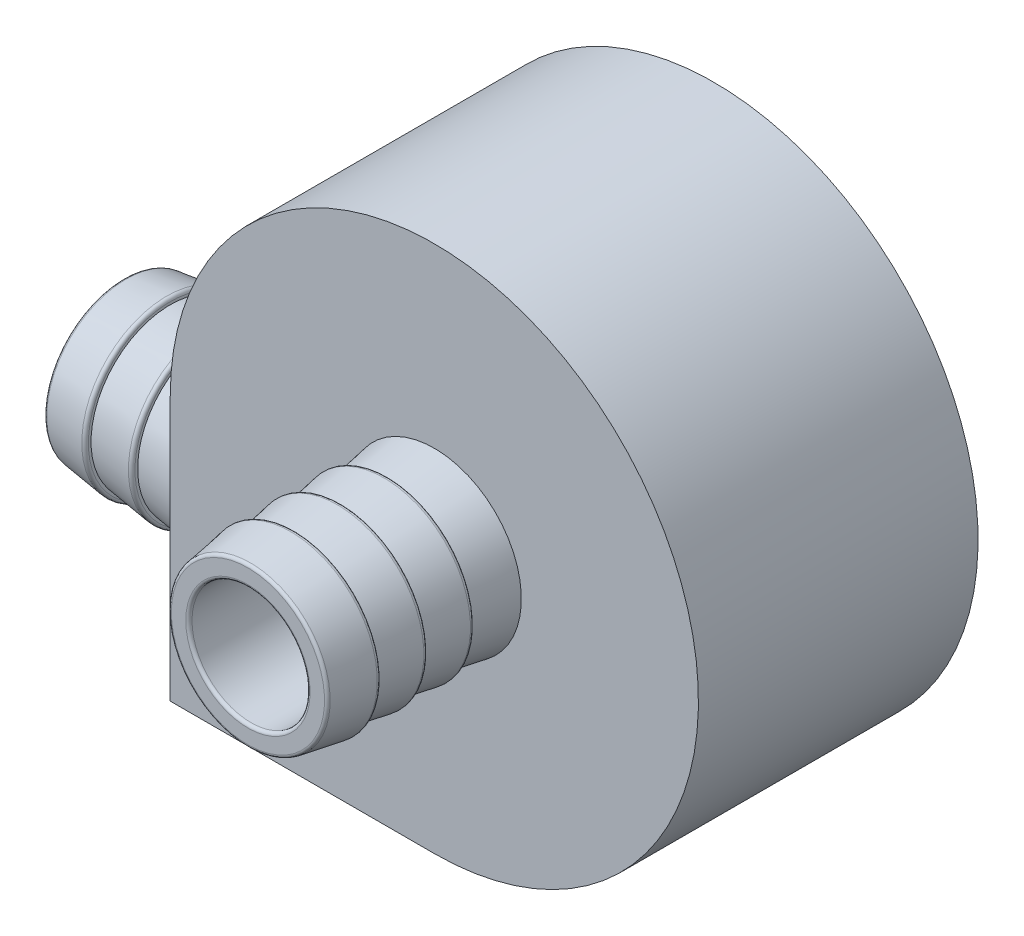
ISO-10303-21;
HEADER;
FILE_DESCRIPTION(('STEP AP214'),'2;1');
FILE_NAME('part.step','',(''),(''),'','','');
FILE_SCHEMA(('AUTOMOTIVE_DESIGN { 1 0 10303 214 1 1 1 1 }'));
ENDSEC;
DATA;
#1=APPLICATION_CONTEXT('core data for automotive mechanical design processes');
#2=APPLICATION_PROTOCOL_DEFINITION('international standard','automotive_design',2000,#1);
#3=PRODUCT_CONTEXT('',#1,'mechanical');
#4=PRODUCT('Part','Part','',(#3));
#5=PRODUCT_RELATED_PRODUCT_CATEGORY('part','',(#4));
#6=PRODUCT_DEFINITION_FORMATION('','',#4);
#7=PRODUCT_DEFINITION_CONTEXT('part definition',#1,'design');
#8=PRODUCT_DEFINITION('design','',#6,#7);
#9=PRODUCT_DEFINITION_SHAPE('','',#8);
#10=(LENGTH_UNIT() NAMED_UNIT(*) SI_UNIT(.MILLI.,.METRE.));
#11=(NAMED_UNIT(*) PLANE_ANGLE_UNIT() SI_UNIT($,.RADIAN.));
#12=(NAMED_UNIT(*) SI_UNIT($,.STERADIAN.) SOLID_ANGLE_UNIT());
#13=UNCERTAINTY_MEASURE_WITH_UNIT(LENGTH_MEASURE(1.E-05),#10,'distance_accuracy_value','');
#14=(GEOMETRIC_REPRESENTATION_CONTEXT(3) GLOBAL_UNCERTAINTY_ASSIGNED_CONTEXT((#13)) GLOBAL_UNIT_ASSIGNED_CONTEXT((#10,
#11,#12)) REPRESENTATION_CONTEXT('',''));
#15=CARTESIAN_POINT('',(0.,0.,0.));
#16=DIRECTION('',(0.,0.,1.));
#17=DIRECTION('',(1.,0.,0.));
#18=AXIS2_PLACEMENT_3D('',#15,#16,#17);
#19=CARTESIAN_POINT('',(-21.59,0.,22.86));
#20=DIRECTION('',(1.,0.,0.));
#21=DIRECTION('',(0.,0.,-1.));
#22=AXIS2_PLACEMENT_3D('',#19,#20,#21);
#23=PLANE('',#22);
#24=DIRECTION('',(0.,-1.,0.));
#25=VECTOR('',#24,1.);
#26=CARTESIAN_POINT('',(-21.59,0.,0.));
#27=LINE('',#26,#25);
#28=CARTESIAN_POINT('',(-21.59,0.,0.));
#29=VERTEX_POINT('',#28);
#30=CARTESIAN_POINT('',(-21.59,-21.59,0.));
#31=VERTEX_POINT('',#30);
#32=EDGE_CURVE('E174',#29,#31,#27,.T.);
#33=ORIENTED_EDGE('',*,*,#32,.T.);
#34=DIRECTION('',(0.,0.,-1.));
#35=VECTOR('',#34,1.);
#36=CARTESIAN_POINT('',(-21.59,-21.59,22.86));
#37=LINE('',#36,#35);
#38=CARTESIAN_POINT('',(-21.59,-21.59,22.86));
#39=VERTEX_POINT('',#38);
#40=EDGE_CURVE('E178',#39,#31,#37,.T.);
#41=ORIENTED_EDGE('',*,*,#40,.F.);
#42=DIRECTION('',(0.,-1.,0.));
#43=VECTOR('',#42,1.);
#44=CARTESIAN_POINT('',(-21.59,0.,22.86));
#45=LINE('',#44,#43);
#46=CARTESIAN_POINT('',(-21.59,0.,22.86));
#47=VERTEX_POINT('',#46);
#48=EDGE_CURVE('E93',#47,#39,#45,.T.);
#49=ORIENTED_EDGE('',*,*,#48,.F.);
#50=DIRECTION('',(0.,0.,-1.));
#51=VECTOR('',#50,1.);
#52=CARTESIAN_POINT('',(-21.59,0.,22.86));
#53=LINE('',#52,#51);
#54=EDGE_CURVE('E180',#47,#29,#53,.T.);
#55=ORIENTED_EDGE('',*,*,#54,.T.);
#56=EDGE_LOOP('',(#33,#41,#49,#55));
#57=FACE_BOUND('',#56,.T.);
#58=CARTESIAN_POINT('',(-21.59,-11.43,11.43));
#59=DIRECTION('',(1.,0.,0.));
#60=DIRECTION('',(0.,0.,-1.));
#61=AXIS2_PLACEMENT_3D('',#58,#59,#60);
#62=CIRCLE('',#61,6.985);
#63=CARTESIAN_POINT('',(-21.59,-11.43,4.445));
#64=VERTEX_POINT('',#63);
#65=EDGE_CURVE('E98',#64,#64,#62,.F.);
#66=ORIENTED_EDGE('',*,*,#65,.F.);
#67=EDGE_LOOP('',(#66));
#68=FACE_BOUND('',#67,.T.);
#69=ADVANCED_FACE('F41',(#57,#68),#23,.F.);
#70=CARTESIAN_POINT('',(0.,0.,22.86));
#71=DIRECTION('',(0.,0.,-1.));
#72=DIRECTION('',(-1.,0.,0.));
#73=AXIS2_PLACEMENT_3D('',#70,#71,#72);
#74=CYLINDRICAL_SURFACE('',#73,4.826);
#75=CARTESIAN_POINT('',(0.,0.,37.846));
#76=DIRECTION('',(0.,0.,-1.));
#77=DIRECTION('',(-1.,0.,0.));
#78=AXIS2_PLACEMENT_3D('',#75,#76,#77);
#79=CIRCLE('',#78,4.826);
#80=CARTESIAN_POINT('',(-4.826,0.,37.846));
#81=VERTEX_POINT('',#80);
#82=EDGE_CURVE('E163',#81,#81,#79,.T.);
#83=ORIENTED_EDGE('',*,*,#82,.F.);
#84=EDGE_LOOP('',(#83));
#85=FACE_BOUND('',#84,.T.);
#86=CARTESIAN_POINT('',(0.,0.,20.32));
#87=DIRECTION('',(0.,0.,-1.));
#88=DIRECTION('',(-1.,0.,0.));
#89=AXIS2_PLACEMENT_3D('',#86,#87,#88);
#90=CIRCLE('',#89,4.826);
#91=CARTESIAN_POINT('',(-4.826,0.,20.32));
#92=VERTEX_POINT('',#91);
#93=EDGE_CURVE('E118',#92,#92,#90,.F.);
#94=ORIENTED_EDGE('',*,*,#93,.F.);
#95=EDGE_LOOP('',(#94));
#96=FACE_BOUND('',#95,.T.);
#97=ADVANCED_FACE('F190',(#85,#96),#74,.F.);
#98=CARTESIAN_POINT('',(0.,0.,22.86));
#99=DIRECTION('',(0.,0.,1.));
#100=DIRECTION('',(1.,0.,0.));
#101=AXIS2_PLACEMENT_3D('',#98,#99,#100);
#102=PLANE('',#101);
#103=CARTESIAN_POINT('',(0.,0.,22.86));
#104=DIRECTION('',(0.,0.,1.));
#105=DIRECTION('',(1.,0.,0.));
#106=AXIS2_PLACEMENT_3D('',#103,#104,#105);
#107=CIRCLE('',#106,21.59);
#108=CARTESIAN_POINT('',(0.,-21.59,22.86));
#109=VERTEX_POINT('',#108);
#110=EDGE_CURVE('E167',#109,#47,#107,.T.);
#111=ORIENTED_EDGE('',*,*,#110,.T.);
#112=ORIENTED_EDGE('',*,*,#48,.T.);
#113=DIRECTION('',(1.,0.,0.));
#114=VECTOR('',#113,1.);
#115=CARTESIAN_POINT('',(0.,-21.59,22.86));
#116=LINE('',#115,#114);
#117=EDGE_CURVE('E70',#39,#109,#116,.T.);
#118=ORIENTED_EDGE('',*,*,#117,.T.);
#119=EDGE_LOOP('',(#111,#112,#118));
#120=FACE_BOUND('',#119,.T.);
#121=CARTESIAN_POINT('',(0.,0.,22.86));
#122=DIRECTION('',(0.,0.,-1.));
#123=DIRECTION('',(-1.,0.,0.));
#124=AXIS2_PLACEMENT_3D('',#121,#122,#123);
#125=CIRCLE('',#124,7.112);
#126=CARTESIAN_POINT('',(-7.112,0.,22.86));
#127=VERTEX_POINT('',#126);
#128=EDGE_CURVE('E124',#127,#127,#125,.T.);
#129=ORIENTED_EDGE('',*,*,#128,.T.);
#130=EDGE_LOOP('',(#129));
#131=FACE_BOUND('',#130,.T.);
#132=ADVANCED_FACE('F196',(#120,#131),#102,.T.);
#133=CARTESIAN_POINT('',(0.,0.,22.86));
#134=DIRECTION('',(0.,0.,-1.));
#135=DIRECTION('',(-1.,0.,0.));
#136=AXIS2_PLACEMENT_3D('',#133,#134,#135);
#137=CYLINDRICAL_SURFACE('',#136,21.59);
#138=CARTESIAN_POINT('',(0.,0.,0.));
#139=DIRECTION('',(0.,0.,1.));
#140=DIRECTION('',(1.,0.,0.));
#141=AXIS2_PLACEMENT_3D('',#138,#139,#140);
#142=CIRCLE('',#141,21.59);
#143=CARTESIAN_POINT('',(0.,-21.59,0.));
#144=VERTEX_POINT('',#143);
#145=EDGE_CURVE('E166',#144,#29,#142,.T.);
#146=ORIENTED_EDGE('',*,*,#145,.T.);
#147=ORIENTED_EDGE('',*,*,#54,.F.);
#148=ORIENTED_EDGE('',*,*,#110,.F.);
#149=DIRECTION('',(0.,0.,-1.));
#150=VECTOR('',#149,1.);
#151=CARTESIAN_POINT('',(0.,-21.59,22.86));
#152=LINE('',#151,#150);
#153=EDGE_CURVE('E171',#109,#144,#152,.T.);
#154=ORIENTED_EDGE('',*,*,#153,.T.);
#155=EDGE_LOOP('',(#146,#147,#148,#154));
#156=FACE_BOUND('',#155,.T.);
#157=ADVANCED_FACE('F43',(#156),#137,.T.);
#158=CARTESIAN_POINT('',(0.,-21.59,22.86));
#159=DIRECTION('',(0.,1.,0.));
#160=DIRECTION('',(0.,0.,1.));
#161=AXIS2_PLACEMENT_3D('',#158,#159,#160);
#162=PLANE('',#161);
#163=DIRECTION('',(1.,0.,0.));
#164=VECTOR('',#163,1.);
#165=CARTESIAN_POINT('',(0.,-21.59,0.));
#166=LINE('',#165,#164);
#167=EDGE_CURVE('E87',#31,#144,#166,.T.);
#168=ORIENTED_EDGE('',*,*,#167,.T.);
#169=ORIENTED_EDGE('',*,*,#153,.F.);
#170=ORIENTED_EDGE('',*,*,#117,.F.);
#171=ORIENTED_EDGE('',*,*,#40,.T.);
#172=EDGE_LOOP('',(#168,#169,#170,#171));
#173=FACE_BOUND('',#172,.T.);
#174=ADVANCED_FACE('F200',(#173),#162,.F.);
#175=CARTESIAN_POINT('',(0.,0.,0.));
#176=DIRECTION('',(0.,0.,1.));
#177=DIRECTION('',(1.,0.,0.));
#178=AXIS2_PLACEMENT_3D('',#175,#176,#177);
#179=PLANE('',#178);
#180=CARTESIAN_POINT('',(0.,0.,0.));
#181=DIRECTION('',(0.,0.,-1.));
#182=DIRECTION('',(-1.,0.,0.));
#183=AXIS2_PLACEMENT_3D('',#180,#181,#182);
#184=CIRCLE('',#183,17.1565171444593);
#185=CARTESIAN_POINT('',(-17.1565171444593,0.,0.));
#186=VERTEX_POINT('',#185);
#187=EDGE_CURVE('E114',#186,#186,#184,.T.);
#188=ORIENTED_EDGE('',*,*,#187,.F.);
#189=EDGE_LOOP('',(#188));
#190=FACE_BOUND('',#189,.T.);
#191=ORIENTED_EDGE('',*,*,#145,.F.);
#192=ORIENTED_EDGE('',*,*,#167,.F.);
#193=ORIENTED_EDGE('',*,*,#32,.F.);
#194=EDGE_LOOP('',(#191,#192,#193));
#195=FACE_BOUND('',#194,.T.);
#196=ADVANCED_FACE('F203',(#190,#195),#179,.F.);
#197=CARTESIAN_POINT('',(0.,0.,37.846));
#198=DIRECTION('',(0.,0.,-1.));
#199=DIRECTION('',(-1.,0.,0.));
#200=AXIS2_PLACEMENT_3D('',#197,#198,#199);
#201=TOROIDAL_SURFACE('',#200,5.08,0.253999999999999);
#202=CARTESIAN_POINT('',(0.,0.,38.1));
#203=DIRECTION('',(0.,0.,-1.));
#204=DIRECTION('',(-1.,0.,0.));
#205=AXIS2_PLACEMENT_3D('',#202,#203,#204);
#206=CIRCLE('',#205,5.08);
#207=CARTESIAN_POINT('',(-5.08,0.,38.1));
#208=VERTEX_POINT('',#207);
#209=EDGE_CURVE('E160',#208,#208,#206,.T.);
#210=ORIENTED_EDGE('',*,*,#209,.F.);
#211=EDGE_LOOP('',(#210));
#212=FACE_BOUND('',#211,.T.);
#213=ORIENTED_EDGE('',*,*,#82,.T.);
#214=EDGE_LOOP('',(#213));
#215=FACE_BOUND('',#214,.T.);
#216=ADVANCED_FACE('F206',(#212,#215),#201,.T.);
#217=CARTESIAN_POINT('',(5.08,0.,38.1));
#218=DIRECTION('',(0.,0.,-1.));
#219=DIRECTION('',(-1.,0.,0.));
#220=AXIS2_PLACEMENT_3D('',#217,#218,#219);
#221=PLANE('',#220);
#222=CARTESIAN_POINT('',(0.,0.,38.1));
#223=DIRECTION('',(0.,0.,-1.));
#224=DIRECTION('',(-1.,0.,0.));
#225=AXIS2_PLACEMENT_3D('',#222,#223,#224);
#226=CIRCLE('',#225,6.26182971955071);
#227=CARTESIAN_POINT('',(-6.26182971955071,0.,38.1));
#228=VERTEX_POINT('',#227);
#229=EDGE_CURVE('E157',#228,#228,#226,.T.);
#230=ORIENTED_EDGE('',*,*,#229,.F.);
#231=EDGE_LOOP('',(#230));
#232=FACE_BOUND('',#231,.T.);
#233=ORIENTED_EDGE('',*,*,#209,.T.);
#234=EDGE_LOOP('',(#233));
#235=FACE_BOUND('',#234,.T.);
#236=ADVANCED_FACE('F211',(#232,#235),#221,.F.);
#237=CARTESIAN_POINT('',(0.,0.,37.846));
#238=DIRECTION('',(0.,0.,-1.));
#239=DIRECTION('',(-1.,0.,0.));
#240=AXIS2_PLACEMENT_3D('',#237,#238,#239);
#241=TOROIDAL_SURFACE('',#240,6.26182971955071,0.253999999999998);
#242=CARTESIAN_POINT('',(0.,0.,37.8877573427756));
#243=DIRECTION('',(0.,0.,-1.));
#244=DIRECTION('',(-1.,0.,0.));
#245=AXIS2_PLACEMENT_3D('',#242,#243,#244);
#246=CIRCLE('',#245,6.51237377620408);
#247=CARTESIAN_POINT('',(-6.51237377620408,0.,37.8877573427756));
#248=VERTEX_POINT('',#247);
#249=EDGE_CURVE('E154',#248,#248,#246,.T.);
#250=ORIENTED_EDGE('',*,*,#249,.F.);
#251=EDGE_LOOP('',(#250));
#252=FACE_BOUND('',#251,.T.);
#253=ORIENTED_EDGE('',*,*,#229,.T.);
#254=EDGE_LOOP('',(#253));
#255=FACE_BOUND('',#254,.T.);
#256=ADVANCED_FACE('F215',(#252,#255),#241,.T.);
#257=CARTESIAN_POINT('',(0.,0.,37.8877573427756));
#258=DIRECTION('',(0.,0.,-1.));
#259=DIRECTION('',(-1.,0.,0.));
#260=AXIS2_PLACEMENT_3D('',#257,#258,#259);
#261=CONICAL_SURFACE('',#260,6.51237377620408,0.165148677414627);
#262=CARTESIAN_POINT('',(0.,0.,34.5857573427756));
#263=DIRECTION('',(0.,0.,-1.));
#264=DIRECTION('',(-1.,0.,0.));
#265=AXIS2_PLACEMENT_3D('',#262,#263,#264);
#266=CIRCLE('',#265,7.06270710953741);
#267=CARTESIAN_POINT('',(-7.06270710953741,0.,34.5857573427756));
#268=VERTEX_POINT('',#267);
#269=EDGE_CURVE('E151',#268,#268,#266,.T.);
#270=ORIENTED_EDGE('',*,*,#269,.F.);
#271=EDGE_LOOP('',(#270));
#272=FACE_BOUND('',#271,.T.);
#273=ORIENTED_EDGE('',*,*,#249,.T.);
#274=EDGE_LOOP('',(#273));
#275=FACE_BOUND('',#274,.T.);
#276=ADVANCED_FACE('F219',(#272,#275),#261,.T.);
#277=CARTESIAN_POINT('',(0.,0.,34.544));
#278=DIRECTION('',(0.,0.,-1.));
#279=DIRECTION('',(-1.,0.,0.));
#280=AXIS2_PLACEMENT_3D('',#277,#278,#279);
#281=TOROIDAL_SURFACE('',#280,6.81216305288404,0.253999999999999);
#282=CARTESIAN_POINT('',(0.,0.,34.29));
#283=DIRECTION('',(0.,0.,-1.));
#284=DIRECTION('',(-1.,0.,0.));
#285=AXIS2_PLACEMENT_3D('',#282,#283,#284);
#286=CIRCLE('',#285,6.81216305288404);
#287=CARTESIAN_POINT('',(-6.81216305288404,0.,34.29));
#288=VERTEX_POINT('',#287);
#289=EDGE_CURVE('E148',#288,#288,#286,.T.);
#290=ORIENTED_EDGE('',*,*,#289,.F.);
#291=EDGE_LOOP('',(#290));
#292=FACE_BOUND('',#291,.T.);
#293=ORIENTED_EDGE('',*,*,#269,.T.);
#294=EDGE_LOOP('',(#293));
#295=FACE_BOUND('',#294,.T.);
#296=ADVANCED_FACE('F223',(#292,#295),#281,.T.);
#297=CARTESIAN_POINT('',(6.81216305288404,0.,34.29));
#298=DIRECTION('',(0.,0.,1.));
#299=DIRECTION('',(1.,0.,0.));
#300=AXIS2_PLACEMENT_3D('',#297,#298,#299);
#301=PLANE('',#300);
#302=CARTESIAN_POINT('',(0.,0.,34.29));
#303=DIRECTION('',(0.,0.,-1.));
#304=DIRECTION('',(-1.,0.,0.));
#305=AXIS2_PLACEMENT_3D('',#302,#303,#304);
#306=CIRCLE('',#305,6.477);
#307=CARTESIAN_POINT('',(-6.477,0.,34.29));
#308=VERTEX_POINT('',#307);
#309=EDGE_CURVE('E145',#308,#308,#306,.T.);
#310=ORIENTED_EDGE('',*,*,#309,.F.);
#311=EDGE_LOOP('',(#310));
#312=FACE_BOUND('',#311,.T.);
#313=ORIENTED_EDGE('',*,*,#289,.T.);
#314=EDGE_LOOP('',(#313));
#315=FACE_BOUND('',#314,.T.);
#316=ADVANCED_FACE('F227',(#312,#315),#301,.F.);
#317=CARTESIAN_POINT('',(0.,0.,34.29));
#318=DIRECTION('',(0.,0.,-1.));
#319=DIRECTION('',(-1.,0.,0.));
#320=AXIS2_PLACEMENT_3D('',#317,#318,#319);
#321=CONICAL_SURFACE('',#320,6.477,0.165148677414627);
#322=CARTESIAN_POINT('',(0.,0.,30.7757573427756));
#323=DIRECTION('',(0.,0.,-1.));
#324=DIRECTION('',(-1.,0.,0.));
#325=AXIS2_PLACEMENT_3D('',#322,#323,#324);
#326=CIRCLE('',#325,7.06270710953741);
#327=CARTESIAN_POINT('',(-7.06270710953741,0.,30.7757573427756));
#328=VERTEX_POINT('',#327);
#329=EDGE_CURVE('E142',#328,#328,#326,.T.);
#330=ORIENTED_EDGE('',*,*,#329,.F.);
#331=EDGE_LOOP('',(#330));
#332=FACE_BOUND('',#331,.T.);
#333=ORIENTED_EDGE('',*,*,#309,.T.);
#334=EDGE_LOOP('',(#333));
#335=FACE_BOUND('',#334,.T.);
#336=ADVANCED_FACE('F231',(#332,#335),#321,.T.);
#337=CARTESIAN_POINT('',(0.,0.,30.734));
#338=DIRECTION('',(0.,0.,-1.));
#339=DIRECTION('',(-1.,0.,0.));
#340=AXIS2_PLACEMENT_3D('',#337,#338,#339);
#341=TOROIDAL_SURFACE('',#340,6.81216305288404,0.254);
#342=CARTESIAN_POINT('',(0.,0.,30.48));
#343=DIRECTION('',(0.,0.,-1.));
#344=DIRECTION('',(-1.,0.,0.));
#345=AXIS2_PLACEMENT_3D('',#342,#343,#344);
#346=CIRCLE('',#345,6.81216305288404);
#347=CARTESIAN_POINT('',(-6.81216305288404,0.,30.48));
#348=VERTEX_POINT('',#347);
#349=EDGE_CURVE('E139',#348,#348,#346,.T.);
#350=ORIENTED_EDGE('',*,*,#349,.F.);
#351=EDGE_LOOP('',(#350));
#352=FACE_BOUND('',#351,.T.);
#353=ORIENTED_EDGE('',*,*,#329,.T.);
#354=EDGE_LOOP('',(#353));
#355=FACE_BOUND('',#354,.T.);
#356=ADVANCED_FACE('F235',(#352,#355),#341,.T.);
#357=CARTESIAN_POINT('',(6.81216305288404,0.,30.48));
#358=DIRECTION('',(0.,0.,1.));
#359=DIRECTION('',(1.,0.,0.));
#360=AXIS2_PLACEMENT_3D('',#357,#358,#359);
#361=PLANE('',#360);
#362=CARTESIAN_POINT('',(0.,0.,30.48));
#363=DIRECTION('',(0.,0.,-1.));
#364=DIRECTION('',(-1.,0.,0.));
#365=AXIS2_PLACEMENT_3D('',#362,#363,#364);
#366=CIRCLE('',#365,6.477);
#367=CARTESIAN_POINT('',(-6.477,0.,30.48));
#368=VERTEX_POINT('',#367);
#369=EDGE_CURVE('E136',#368,#368,#366,.T.);
#370=ORIENTED_EDGE('',*,*,#369,.F.);
#371=EDGE_LOOP('',(#370));
#372=FACE_BOUND('',#371,.T.);
#373=ORIENTED_EDGE('',*,*,#349,.T.);
#374=EDGE_LOOP('',(#373));
#375=FACE_BOUND('',#374,.T.);
#376=ADVANCED_FACE('F239',(#372,#375),#361,.F.);
#377=CARTESIAN_POINT('',(0.,0.,30.48));
#378=DIRECTION('',(0.,0.,-1.));
#379=DIRECTION('',(-1.,0.,0.));
#380=AXIS2_PLACEMENT_3D('',#377,#378,#379);
#381=CONICAL_SURFACE('',#380,6.477,0.165148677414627);
#382=CARTESIAN_POINT('',(0.,0.,26.9657573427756));
#383=DIRECTION('',(0.,0.,-1.));
#384=DIRECTION('',(-1.,0.,0.));
#385=AXIS2_PLACEMENT_3D('',#382,#383,#384);
#386=CIRCLE('',#385,7.06270710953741);
#387=CARTESIAN_POINT('',(-7.06270710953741,0.,26.9657573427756));
#388=VERTEX_POINT('',#387);
#389=EDGE_CURVE('E133',#388,#388,#386,.T.);
#390=ORIENTED_EDGE('',*,*,#389,.F.);
#391=EDGE_LOOP('',(#390));
#392=FACE_BOUND('',#391,.T.);
#393=ORIENTED_EDGE('',*,*,#369,.T.);
#394=EDGE_LOOP('',(#393));
#395=FACE_BOUND('',#394,.T.);
#396=ADVANCED_FACE('F243',(#392,#395),#381,.T.);
#397=CARTESIAN_POINT('',(0.,0.,26.924));
#398=DIRECTION('',(0.,0.,-1.));
#399=DIRECTION('',(-1.,0.,0.));
#400=AXIS2_PLACEMENT_3D('',#397,#398,#399);
#401=TOROIDAL_SURFACE('',#400,6.81216305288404,0.254);
#402=CARTESIAN_POINT('',(0.,0.,26.67));
#403=DIRECTION('',(0.,0.,-1.));
#404=DIRECTION('',(-1.,0.,0.));
#405=AXIS2_PLACEMENT_3D('',#402,#403,#404);
#406=CIRCLE('',#405,6.81216305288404);
#407=CARTESIAN_POINT('',(-6.81216305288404,0.,26.67));
#408=VERTEX_POINT('',#407);
#409=EDGE_CURVE('E130',#408,#408,#406,.T.);
#410=ORIENTED_EDGE('',*,*,#409,.F.);
#411=EDGE_LOOP('',(#410));
#412=FACE_BOUND('',#411,.T.);
#413=ORIENTED_EDGE('',*,*,#389,.T.);
#414=EDGE_LOOP('',(#413));
#415=FACE_BOUND('',#414,.T.);
#416=ADVANCED_FACE('F247',(#412,#415),#401,.T.);
#417=CARTESIAN_POINT('',(6.81216305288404,0.,26.67));
#418=DIRECTION('',(0.,0.,1.));
#419=DIRECTION('',(1.,0.,0.));
#420=AXIS2_PLACEMENT_3D('',#417,#418,#419);
#421=PLANE('',#420);
#422=CARTESIAN_POINT('',(0.,0.,26.67));
#423=DIRECTION('',(0.,0.,-1.));
#424=DIRECTION('',(-1.,0.,0.));
#425=AXIS2_PLACEMENT_3D('',#422,#423,#424);
#426=CIRCLE('',#425,6.477);
#427=CARTESIAN_POINT('',(-6.477,0.,26.67));
#428=VERTEX_POINT('',#427);
#429=EDGE_CURVE('E127',#428,#428,#426,.T.);
#430=ORIENTED_EDGE('',*,*,#429,.F.);
#431=EDGE_LOOP('',(#430));
#432=FACE_BOUND('',#431,.T.);
#433=ORIENTED_EDGE('',*,*,#409,.T.);
#434=EDGE_LOOP('',(#433));
#435=FACE_BOUND('',#434,.T.);
#436=ADVANCED_FACE('F251',(#432,#435),#421,.F.);
#437=CARTESIAN_POINT('',(0.,0.,26.67));
#438=DIRECTION('',(0.,0.,-1.));
#439=DIRECTION('',(-1.,0.,0.));
#440=AXIS2_PLACEMENT_3D('',#437,#438,#439);
#441=CONICAL_SURFACE('',#440,6.477,0.165148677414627);
#442=ORIENTED_EDGE('',*,*,#128,.F.);
#443=EDGE_LOOP('',(#442));
#444=FACE_BOUND('',#443,.T.);
#445=ORIENTED_EDGE('',*,*,#429,.T.);
#446=EDGE_LOOP('',(#445));
#447=FACE_BOUND('',#446,.T.);
#448=ADVANCED_FACE('F255',(#444,#447),#441,.T.);
#449=CARTESIAN_POINT('',(0.,0.,20.32));
#450=DIRECTION('',(0.,0.,-1.));
#451=DIRECTION('',(-1.,0.,0.));
#452=AXIS2_PLACEMENT_3D('',#449,#450,#451);
#453=PLANE('',#452);
#454=CARTESIAN_POINT('',(0.,0.,20.32));
#455=DIRECTION('',(0.,0.,-1.));
#456=DIRECTION('',(-1.,0.,0.));
#457=AXIS2_PLACEMENT_3D('',#454,#455,#456);
#458=CIRCLE('',#457,17.1565171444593);
#459=CARTESIAN_POINT('',(-17.1565171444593,0.,20.32));
#460=VERTEX_POINT('',#459);
#461=EDGE_CURVE('E111',#460,#460,#458,.T.);
#462=ORIENTED_EDGE('',*,*,#461,.T.);
#463=EDGE_LOOP('',(#462));
#464=FACE_BOUND('',#463,.T.);
#465=ORIENTED_EDGE('',*,*,#93,.T.);
#466=EDGE_LOOP('',(#465));
#467=FACE_BOUND('',#466,.T.);
#468=ADVANCED_FACE('F107',(#464,#467),#453,.T.);
#469=CARTESIAN_POINT('',(0.,0.,20.32));
#470=DIRECTION('',(0.,0.,-1.));
#471=DIRECTION('',(-1.,0.,0.));
#472=AXIS2_PLACEMENT_3D('',#469,#470,#471);
#473=CYLINDRICAL_SURFACE('',#472,17.1565171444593);
#474=DIRECTION('',(0.,0.,-1.));
#475=VECTOR('',#474,1.);
#476=CARTESIAN_POINT('',(-8.89,-14.6735810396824,20.32));
#477=LINE('',#476,#475);
#478=CARTESIAN_POINT('',(-8.89,-14.6735810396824,15.1731792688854));
#479=VERTEX_POINT('',#478);
#480=CARTESIAN_POINT('',(-8.89,-14.6735810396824,7.68682073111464));
#481=VERTEX_POINT('',#480);
#482=EDGE_CURVE('E55',#479,#481,#477,.T.);
#483=ORIENTED_EDGE('',*,*,#482,.F.);
#484=CARTESIAN_POINT('',(-8.89,-14.6735810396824,15.1731792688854));
#485=CARTESIAN_POINT('',(-9.01881497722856,-14.5955408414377,15.2407903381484));
#486=CARTESIAN_POINT('',(-9.14749021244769,-14.5152616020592,15.3060948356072));
#487=CARTESIAN_POINT('',(-9.40431594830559,-14.3501989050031,15.4319303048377));
#488=CARTESIAN_POINT('',(-9.5324663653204,-14.2654147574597,15.4924605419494));
#489=CARTESIAN_POINT('',(-9.78830113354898,-14.0911059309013,15.6087224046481));
#490=CARTESIAN_POINT('',(-9.91598330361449,-14.0015691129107,15.6644406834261));
#491=CARTESIAN_POINT('',(-10.1702578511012,-13.8179786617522,15.7706232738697));
#492=CARTESIAN_POINT('',(-10.2968502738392,-13.7239252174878,15.821087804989));
#493=CARTESIAN_POINT('',(-10.6776823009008,-13.4326504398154,15.965301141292));
#494=CARTESIAN_POINT('',(-10.9299078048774,-13.2283958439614,16.0504648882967));
#495=CARTESIAN_POINT('',(-11.4262965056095,-12.802056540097,16.1944734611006));
#496=CARTESIAN_POINT('',(-11.6704693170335,-12.5799942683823,16.2533508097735));
#497=CARTESIAN_POINT('',(-12.0557326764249,-12.20847271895,16.3235476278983));
#498=CARTESIAN_POINT('',(-12.2001221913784,-12.064202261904,16.344454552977));
#499=CARTESIAN_POINT('',(-12.4842891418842,-11.7698943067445,16.37353570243));
#500=CARTESIAN_POINT('',(-12.6240666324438,-11.6198568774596,16.3817100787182));
#501=CARTESIAN_POINT('',(-12.8976451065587,-11.3154118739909,16.38400398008));
#502=CARTESIAN_POINT('',(-13.0314683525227,-11.1610248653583,16.3781813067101));
#503=CARTESIAN_POINT('',(-13.2928889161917,-10.8483489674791,16.3512295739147));
#504=CARTESIAN_POINT('',(-13.4204873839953,-10.6900608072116,16.3301033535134));
#505=CARTESIAN_POINT('',(-13.6459814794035,-10.4000298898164,16.2765436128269));
#506=CARTESIAN_POINT('',(-13.7450585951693,-10.2686950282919,16.2468653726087));
#507=CARTESIAN_POINT('',(-13.9379158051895,-10.0053585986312,16.1756508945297));
#508=CARTESIAN_POINT('',(-14.0316968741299,-9.8733571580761,16.1341168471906));
#509=CARTESIAN_POINT('',(-14.2135093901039,-9.60978030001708,16.0385431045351));
#510=CARTESIAN_POINT('',(-14.3015376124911,-9.47820516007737,15.9844964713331));
#511=CARTESIAN_POINT('',(-14.4712932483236,-9.2169419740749,15.8634307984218));
#512=CARTESIAN_POINT('',(-14.5530205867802,-9.08725395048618,15.7964116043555));
#513=CARTESIAN_POINT('',(-14.7103867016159,-8.83026031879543,15.6484979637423));
#514=CARTESIAN_POINT('',(-14.7859681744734,-8.70298411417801,15.5674910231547));
#515=CARTESIAN_POINT('',(-14.9298698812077,-8.45374316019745,15.3919852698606));
#516=CARTESIAN_POINT('',(-14.9981911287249,-8.33177767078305,15.2974883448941));
#517=CARTESIAN_POINT('',(-15.1272618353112,-8.09507247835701,15.0953344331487));
#518=CARTESIAN_POINT('',(-15.1880156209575,-7.98032866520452,14.9876850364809));
#519=CARTESIAN_POINT('',(-15.3018200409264,-7.75988236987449,14.7597993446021));
#520=CARTESIAN_POINT('',(-15.3548720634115,-7.65417825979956,14.6395653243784));
#521=CARTESIAN_POINT('',(-15.4460990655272,-7.46814819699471,14.405722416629));
#522=CARTESIAN_POINT('',(-15.4853158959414,-7.38636380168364,14.2936752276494));
#523=CARTESIAN_POINT('',(-15.558110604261,-7.23177538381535,14.0618289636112));
#524=CARTESIAN_POINT('',(-15.591689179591,-7.15897025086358,13.9420308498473));
#525=CARTESIAN_POINT('',(-15.6532680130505,-7.02330644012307,13.6956206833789));
#526=CARTESIAN_POINT('',(-15.6812701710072,-6.9604443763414,13.5690109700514));
#527=CARTESIAN_POINT('',(-15.7318073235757,-6.84545597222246,13.3099584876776));
#528=CARTESIAN_POINT('',(-15.7543425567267,-6.79332916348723,13.1775159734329));
#529=CARTESIAN_POINT('',(-15.7924412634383,-6.70425468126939,12.9188604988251));
#530=CARTESIAN_POINT('',(-15.8084220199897,-6.66641864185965,12.7930138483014));
#531=CARTESIAN_POINT('',(-15.8359431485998,-6.60077681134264,12.5382078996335));
#532=CARTESIAN_POINT('',(-15.8474820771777,-6.5729742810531,12.4092476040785));
#533=CARTESIAN_POINT('',(-15.8661718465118,-6.5277309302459,12.149281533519));
#534=CARTESIAN_POINT('',(-15.8733250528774,-6.51028452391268,12.0182769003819));
#535=CARTESIAN_POINT('',(-15.8832993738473,-6.48591211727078,11.7550791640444));
#536=CARTESIAN_POINT('',(-15.8861189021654,-6.47898996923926,11.6228856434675));
#537=CARTESIAN_POINT('',(-15.8874240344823,-6.4757887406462,11.3613567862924));
#538=CARTESIAN_POINT('',(-15.8860066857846,-6.47927133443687,11.2320247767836));
#539=CARTESIAN_POINT('',(-15.8790371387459,-6.49633319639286,10.9740928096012));
#540=CARTESIAN_POINT('',(-15.8734834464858,-6.50991611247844,10.8454931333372));
#541=CARTESIAN_POINT('',(-15.8582092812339,-6.54703601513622,10.5900461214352));
#542=CARTESIAN_POINT('',(-15.8484905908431,-6.57056874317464,10.4631980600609));
#543=CARTESIAN_POINT('',(-15.8248278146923,-6.62735621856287,10.2120497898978));
#544=CARTESIAN_POINT('',(-15.8108821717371,-6.66061454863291,10.0877505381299));
#545=CARTESIAN_POINT('',(-15.7787224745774,-6.73644484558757,9.84281416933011));
#546=CARTESIAN_POINT('',(-15.760515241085,-6.77900192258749,9.72217154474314));
#547=CARTESIAN_POINT('',(-15.7197361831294,-6.87303427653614,9.48512553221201));
#548=CARTESIAN_POINT('',(-15.6971627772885,-6.92451278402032,9.36872369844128));
#549=CARTESIAN_POINT('',(-15.6475907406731,-7.03581489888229,9.14102703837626));
#550=CARTESIAN_POINT('',(-15.6205940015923,-7.09563493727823,9.02973005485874));
#551=CARTESIAN_POINT('',(-15.562095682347,-7.22303071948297,8.81285590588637));
#552=CARTESIAN_POINT('',(-15.5305924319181,-7.29060933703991,8.70728088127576));
#553=CARTESIAN_POINT('',(-15.462528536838,-7.433886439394,8.50095741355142));
#554=CARTESIAN_POINT('',(-15.4258983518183,-7.5096926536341,8.40030662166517));
#555=CARTESIAN_POINT('',(-15.3479451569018,-7.6677537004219,8.20611796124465));
#556=CARTESIAN_POINT('',(-15.3066204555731,-7.75001085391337,8.11258267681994));
#557=CARTESIAN_POINT('',(-15.1756432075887,-8.00514402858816,7.84342420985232));
#558=CARTESIAN_POINT('',(-15.0789281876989,-8.18650952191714,7.67906683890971));
#559=CARTESIAN_POINT('',(-14.8619870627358,-8.57433888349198,7.37520737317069));
#560=CARTESIAN_POINT('',(-14.7407954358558,-8.78161950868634,7.23745614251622));
#561=CARTESIAN_POINT('',(-14.4800457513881,-9.20523020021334,6.99808780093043));
#562=CARTESIAN_POINT('',(-14.3404806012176,-9.42156373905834,6.89648470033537));
#563=CARTESIAN_POINT('',(-14.0274752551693,-9.88243509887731,6.71773384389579));
#564=CARTESIAN_POINT('',(-13.8519800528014,-10.1272556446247,6.64495607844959));
#565=CARTESIAN_POINT('',(-13.4839094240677,-10.6124036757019,6.53862973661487));
#566=CARTESIAN_POINT('',(-13.2913273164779,-10.8527293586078,6.5050965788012));
#567=CARTESIAN_POINT('',(-12.9374207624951,-11.2706033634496,6.47618972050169));
#568=CARTESIAN_POINT('',(-12.7788468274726,-11.4500822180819,6.47391363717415));
#569=CARTESIAN_POINT('',(-12.4546384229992,-11.8019186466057,6.48784554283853));
#570=CARTESIAN_POINT('',(-12.2890007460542,-11.9742729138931,6.50406201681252));
#571=CARTESIAN_POINT('',(-11.9513223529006,-12.3113413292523,6.55305776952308));
#572=CARTESIAN_POINT('',(-11.7792602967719,-12.4760249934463,6.58589784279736));
#573=CARTESIAN_POINT('',(-11.4303368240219,-12.7964684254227,6.6663598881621));
#574=CARTESIAN_POINT('',(-11.2534745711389,-12.952226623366,6.71398445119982));
#575=CARTESIAN_POINT('',(-10.8970877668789,-13.2534390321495,6.82210229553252));
#576=CARTESIAN_POINT('',(-10.7175880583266,-13.3989537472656,6.88250974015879));
#577=CARTESIAN_POINT('',(-10.3556191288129,-13.6806374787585,7.01513086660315));
#578=CARTESIAN_POINT('',(-10.173149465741,-13.8168050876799,7.08734632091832));
#579=CARTESIAN_POINT('',(-9.80788584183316,-14.0784015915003,7.24179608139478));
#580=CARTESIAN_POINT('',(-9.6251133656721,-14.2039242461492,7.32392299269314));
#581=CARTESIAN_POINT('',(-9.25832397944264,-14.4456851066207,7.49808847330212));
#582=CARTESIAN_POINT('',(-9.07430784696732,-14.5619286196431,7.59012130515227));
#583=CARTESIAN_POINT('',(-8.89,-14.6735810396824,7.68682073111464));
#584=B_SPLINE_CURVE_WITH_KNOTS('',3,(#484,#485,#486,#487,#488,#489,#490,#491,#492,#493,#494,
#495,#496,#497,#498,#499,#500,#501,#502,#503,#504,#505,#506,#507,#508,#509,#510,#511,#512,#513,
#514,#515,#516,#517,#518,#519,#520,#521,#522,#523,#524,#525,#526,#527,#528,#529,#530,#531,#532,
#533,#534,#535,#536,#537,#538,#539,#540,#541,#542,#543,#544,#545,#546,#547,#548,#549,#550,#551,
#552,#553,#554,#555,#556,#557,#558,#559,#560,#561,#562,#563,#564,#565,#566,#567,#568,#569,#570,
#571,#572,#573,#574,#575,#576,#577,#578,#579,#580,#581,#582,#583),.UNSPECIFIED.,.F.,.F.,(4,2,2,
2,2,2,2,2,2,2,2,2,2,2,2,2,2,2,2,2,2,2,2,2,2,2,2,2,2,2,2,2,2,2,2,2,2,2,2,2,2,2,2,2,2,2,2,2,2,4),
(0.,0.495245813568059,0.990567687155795,1.48722202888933,1.98385561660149,2.98897798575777,
3.99285329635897,4.60794453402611,5.22302843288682,5.83557667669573,6.44801131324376,
6.94906130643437,7.45001878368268,7.95125469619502,8.45249657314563,8.95797526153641,
9.46338328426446,9.96850100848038,10.4735275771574,10.9054251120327,11.3372691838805,
11.7689658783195,12.2006437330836,12.5973005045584,12.9940860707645,13.3906574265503,
13.7873739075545,14.1750735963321,14.5629133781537,14.9505873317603,15.3384042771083,
15.7256047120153,16.1129456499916,16.500121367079,16.8874409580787,17.2806427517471,
17.6739866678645,18.4599931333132,19.2871333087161,20.1145937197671,21.0408789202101,
21.9675279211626,22.6851131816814,23.4030278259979,24.123587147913,24.8442728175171,
25.560264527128,26.2763638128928,26.9853030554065,27.6938338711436),.UNSPECIFIED.);
#585=EDGE_CURVE('E11',#479,#481,#584,.T.);
#586=ORIENTED_EDGE('',*,*,#585,.T.);
#587=EDGE_LOOP('',(#483,#586));
#588=FACE_BOUND('',#587,.T.);
#589=ORIENTED_EDGE('',*,*,#461,.F.);
#590=EDGE_LOOP('',(#589));
#591=FACE_BOUND('',#590,.T.);
#592=ORIENTED_EDGE('',*,*,#187,.T.);
#593=EDGE_LOOP('',(#592));
#594=FACE_BOUND('',#593,.T.);
#595=ADVANCED_FACE('F103',(#588,#591,#594),#473,.F.);
#596=CARTESIAN_POINT('',(-25.4,-11.43,11.43));
#597=DIRECTION('',(1.,0.,0.));
#598=DIRECTION('',(0.,0.,-1.));
#599=AXIS2_PLACEMENT_3D('',#596,#597,#598);
#600=CONICAL_SURFACE('',#599,6.477,0.132551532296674);
#601=ORIENTED_EDGE('',*,*,#65,.T.);
#602=EDGE_LOOP('',(#601));
#603=FACE_BOUND('',#602,.T.);
#604=CARTESIAN_POINT('',(-25.4,-11.43,11.43));
#605=DIRECTION('',(1.,0.,0.));
#606=DIRECTION('',(0.,0.,-1.));
#607=AXIS2_PLACEMENT_3D('',#604,#605,#606);
#608=CIRCLE('',#607,6.477);
#609=CARTESIAN_POINT('',(-25.4,-11.43,4.953));
#610=VERTEX_POINT('',#609);
#611=EDGE_CURVE('E116',#610,#610,#608,.T.);
#612=ORIENTED_EDGE('',*,*,#611,.T.);
#613=EDGE_LOOP('',(#612));
#614=FACE_BOUND('',#613,.T.);
#615=ADVANCED_FACE('F106',(#603,#614),#600,.T.);
#616=CARTESIAN_POINT('',(-25.4,-11.43,4.73511449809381));
#617=DIRECTION('',(-1.,0.,0.));
#618=DIRECTION('',(0.,0.,1.));
#619=AXIS2_PLACEMENT_3D('',#616,#617,#618);
#620=PLANE('',#619);
#621=ORIENTED_EDGE('',*,*,#611,.F.);
#622=EDGE_LOOP('',(#621));
#623=FACE_BOUND('',#622,.T.);
#624=CARTESIAN_POINT('',(-25.4,-11.43,11.43));
#625=DIRECTION('',(1.,0.,0.));
#626=DIRECTION('',(0.,0.,-1.));
#627=AXIS2_PLACEMENT_3D('',#624,#625,#626);
#628=CIRCLE('',#627,6.69488550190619);
#629=CARTESIAN_POINT('',(-25.4,-11.43,4.73511449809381));
#630=VERTEX_POINT('',#629);
#631=EDGE_CURVE('E121',#630,#630,#628,.T.);
#632=ORIENTED_EDGE('',*,*,#631,.T.);
#633=EDGE_LOOP('',(#632));
#634=FACE_BOUND('',#633,.T.);
#635=ADVANCED_FACE('F264',(#623,#634),#620,.F.);
#636=CARTESIAN_POINT('',(-25.654,-11.43,11.43));
#637=DIRECTION('',(1.,0.,0.));
#638=DIRECTION('',(0.,0.,-1.));
#639=AXIS2_PLACEMENT_3D('',#636,#637,#638);
#640=TOROIDAL_SURFACE('',#639,6.6948855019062,0.254000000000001);
#641=ORIENTED_EDGE('',*,*,#631,.F.);
#642=EDGE_LOOP('',(#641));
#643=FACE_BOUND('',#642,.T.);
#644=CARTESIAN_POINT('',(-25.6875695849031,-11.43,11.43));
#645=DIRECTION('',(1.,0.,0.));
#646=DIRECTION('',(0.,0.,-1.));
#647=AXIS2_PLACEMENT_3D('',#644,#645,#646);
#648=CIRCLE('',#647,6.94665738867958);
#649=CARTESIAN_POINT('',(-25.6875695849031,-11.43,4.48334261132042));
#650=VERTEX_POINT('',#649);
#651=EDGE_CURVE('E534',#650,#650,#648,.T.);
#652=ORIENTED_EDGE('',*,*,#651,.T.);
#653=EDGE_LOOP('',(#652));
#654=FACE_BOUND('',#653,.T.);
#655=ADVANCED_FACE('F267',(#643,#654),#640,.T.);
#656=CARTESIAN_POINT('',(-29.21,-11.43,11.43));
#657=DIRECTION('',(1.,0.,0.));
#658=DIRECTION('',(0.,0.,-1.));
#659=AXIS2_PLACEMENT_3D('',#656,#657,#658);
#660=CONICAL_SURFACE('',#659,6.477,0.132551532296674);
#661=ORIENTED_EDGE('',*,*,#651,.F.);
#662=EDGE_LOOP('',(#661));
#663=FACE_BOUND('',#662,.T.);
#664=CARTESIAN_POINT('',(-29.21,-11.43,11.43));
#665=DIRECTION('',(1.,0.,0.));
#666=DIRECTION('',(0.,0.,-1.));
#667=AXIS2_PLACEMENT_3D('',#664,#665,#666);
#668=CIRCLE('',#667,6.477);
#669=CARTESIAN_POINT('',(-29.21,-11.43,4.953));
#670=VERTEX_POINT('',#669);
#671=EDGE_CURVE('E531',#670,#670,#668,.T.);
#672=ORIENTED_EDGE('',*,*,#671,.T.);
#673=EDGE_LOOP('',(#672));
#674=FACE_BOUND('',#673,.T.);
#675=ADVANCED_FACE('F271',(#663,#674),#660,.T.);
#676=CARTESIAN_POINT('',(-29.21,-11.43,4.73511449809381));
#677=DIRECTION('',(-1.,0.,0.));
#678=DIRECTION('',(0.,0.,1.));
#679=AXIS2_PLACEMENT_3D('',#676,#677,#678);
#680=PLANE('',#679);
#681=ORIENTED_EDGE('',*,*,#671,.F.);
#682=EDGE_LOOP('',(#681));
#683=FACE_BOUND('',#682,.T.);
#684=CARTESIAN_POINT('',(-29.21,-11.43,11.43));
#685=DIRECTION('',(1.,0.,0.));
#686=DIRECTION('',(0.,0.,-1.));
#687=AXIS2_PLACEMENT_3D('',#684,#685,#686);
#688=CIRCLE('',#687,6.69488550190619);
#689=CARTESIAN_POINT('',(-29.21,-11.43,4.7351144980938));
#690=VERTEX_POINT('',#689);
#691=EDGE_CURVE('E528',#690,#690,#688,.T.);
#692=ORIENTED_EDGE('',*,*,#691,.T.);
#693=EDGE_LOOP('',(#692));
#694=FACE_BOUND('',#693,.T.);
#695=ADVANCED_FACE('F275',(#683,#694),#680,.F.);
#696=CARTESIAN_POINT('',(-29.464,-11.43,11.43));
#697=DIRECTION('',(1.,0.,0.));
#698=DIRECTION('',(0.,0.,-1.));
#699=AXIS2_PLACEMENT_3D('',#696,#697,#698);
#700=TOROIDAL_SURFACE('',#699,6.6948855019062,0.254);
#701=ORIENTED_EDGE('',*,*,#691,.F.);
#702=EDGE_LOOP('',(#701));
#703=FACE_BOUND('',#702,.T.);
#704=CARTESIAN_POINT('',(-29.4975695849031,-11.43,11.43));
#705=DIRECTION('',(1.,0.,0.));
#706=DIRECTION('',(0.,0.,-1.));
#707=AXIS2_PLACEMENT_3D('',#704,#705,#706);
#708=CIRCLE('',#707,6.94665738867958);
#709=CARTESIAN_POINT('',(-29.4975695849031,-11.43,4.48334261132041));
#710=VERTEX_POINT('',#709);
#711=EDGE_CURVE('E525',#710,#710,#708,.T.);
#712=ORIENTED_EDGE('',*,*,#711,.T.);
#713=EDGE_LOOP('',(#712));
#714=FACE_BOUND('',#713,.T.);
#715=ADVANCED_FACE('F279',(#703,#714),#700,.T.);
#716=CARTESIAN_POINT('',(-33.02,-11.43,11.43));
#717=DIRECTION('',(1.,0.,0.));
#718=DIRECTION('',(0.,0.,-1.));
#719=AXIS2_PLACEMENT_3D('',#716,#717,#718);
#720=CONICAL_SURFACE('',#719,6.477,0.132551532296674);
#721=ORIENTED_EDGE('',*,*,#711,.F.);
#722=EDGE_LOOP('',(#721));
#723=FACE_BOUND('',#722,.T.);
#724=CARTESIAN_POINT('',(-33.02,-11.43,11.43));
#725=DIRECTION('',(1.,0.,0.));
#726=DIRECTION('',(0.,0.,-1.));
#727=AXIS2_PLACEMENT_3D('',#724,#725,#726);
#728=CIRCLE('',#727,6.477);
#729=CARTESIAN_POINT('',(-33.02,-11.43,4.953));
#730=VERTEX_POINT('',#729);
#731=EDGE_CURVE('E522',#730,#730,#728,.T.);
#732=ORIENTED_EDGE('',*,*,#731,.T.);
#733=EDGE_LOOP('',(#732));
#734=FACE_BOUND('',#733,.T.);
#735=ADVANCED_FACE('F283',(#723,#734),#720,.T.);
#736=CARTESIAN_POINT('',(-33.02,-11.43,4.73511449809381));
#737=DIRECTION('',(-1.,0.,0.));
#738=DIRECTION('',(0.,0.,1.));
#739=AXIS2_PLACEMENT_3D('',#736,#737,#738);
#740=PLANE('',#739);
#741=ORIENTED_EDGE('',*,*,#731,.F.);
#742=EDGE_LOOP('',(#741));
#743=FACE_BOUND('',#742,.T.);
#744=CARTESIAN_POINT('',(-33.02,-11.43,11.43));
#745=DIRECTION('',(1.,0.,0.));
#746=DIRECTION('',(0.,0.,-1.));
#747=AXIS2_PLACEMENT_3D('',#744,#745,#746);
#748=CIRCLE('',#747,6.69488550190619);
#749=CARTESIAN_POINT('',(-33.02,-11.43,4.73511449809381));
#750=VERTEX_POINT('',#749);
#751=EDGE_CURVE('E519',#750,#750,#748,.T.);
#752=ORIENTED_EDGE('',*,*,#751,.T.);
#753=EDGE_LOOP('',(#752));
#754=FACE_BOUND('',#753,.T.);
#755=ADVANCED_FACE('F287',(#743,#754),#740,.F.);
#756=CARTESIAN_POINT('',(-33.274,-11.43,11.43));
#757=DIRECTION('',(1.,0.,0.));
#758=DIRECTION('',(0.,0.,-1.));
#759=AXIS2_PLACEMENT_3D('',#756,#757,#758);
#760=TOROIDAL_SURFACE('',#759,6.69488550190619,0.253999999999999);
#761=ORIENTED_EDGE('',*,*,#751,.F.);
#762=EDGE_LOOP('',(#761));
#763=FACE_BOUND('',#762,.T.);
#764=CARTESIAN_POINT('',(-33.3075695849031,-11.43,11.43));
#765=DIRECTION('',(1.,0.,0.));
#766=DIRECTION('',(0.,0.,-1.));
#767=AXIS2_PLACEMENT_3D('',#764,#765,#766);
#768=CIRCLE('',#767,6.94665738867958);
#769=CARTESIAN_POINT('',(-33.3075695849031,-11.43,4.48334261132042));
#770=VERTEX_POINT('',#769);
#771=EDGE_CURVE('E516',#770,#770,#768,.T.);
#772=ORIENTED_EDGE('',*,*,#771,.T.);
#773=EDGE_LOOP('',(#772));
#774=FACE_BOUND('',#773,.T.);
#775=ADVANCED_FACE('F291',(#763,#774),#760,.T.);
#776=CARTESIAN_POINT('',(-36.6095695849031,-11.43,11.43));
#777=DIRECTION('',(1.,0.,0.));
#778=DIRECTION('',(0.,0.,-1.));
#779=AXIS2_PLACEMENT_3D('',#776,#777,#778);
#780=CONICAL_SURFACE('',#779,6.50639072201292,0.132551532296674);
#781=ORIENTED_EDGE('',*,*,#771,.F.);
#782=EDGE_LOOP('',(#781));
#783=FACE_BOUND('',#782,.T.);
#784=CARTESIAN_POINT('',(-36.6095695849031,-11.43,11.43));
#785=DIRECTION('',(1.,0.,0.));
#786=DIRECTION('',(0.,0.,-1.));
#787=AXIS2_PLACEMENT_3D('',#784,#785,#786);
#788=CIRCLE('',#787,6.50639072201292);
#789=CARTESIAN_POINT('',(-36.6095695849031,-11.43,4.92360927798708));
#790=VERTEX_POINT('',#789);
#791=EDGE_CURVE('E513',#790,#790,#788,.T.);
#792=ORIENTED_EDGE('',*,*,#791,.T.);
#793=EDGE_LOOP('',(#792));
#794=FACE_BOUND('',#793,.T.);
#795=ADVANCED_FACE('F295',(#783,#794),#780,.T.);
#796=CARTESIAN_POINT('',(-36.576,-11.43,11.43));
#797=DIRECTION('',(1.,0.,0.));
#798=DIRECTION('',(0.,0.,-1.));
#799=AXIS2_PLACEMENT_3D('',#796,#797,#798);
#800=TOROIDAL_SURFACE('',#799,6.25461883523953,0.253999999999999);
#801=ORIENTED_EDGE('',*,*,#791,.F.);
#802=EDGE_LOOP('',(#801));
#803=FACE_BOUND('',#802,.T.);
#804=CARTESIAN_POINT('',(-36.83,-11.43,11.43));
#805=DIRECTION('',(1.,0.,0.));
#806=DIRECTION('',(0.,0.,-1.));
#807=AXIS2_PLACEMENT_3D('',#804,#805,#806);
#808=CIRCLE('',#807,6.25461883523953);
#809=CARTESIAN_POINT('',(-36.83,-11.43,5.17538116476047));
#810=VERTEX_POINT('',#809);
#811=EDGE_CURVE('E508',#810,#810,#808,.T.);
#812=ORIENTED_EDGE('',*,*,#811,.T.);
#813=EDGE_LOOP('',(#812));
#814=FACE_BOUND('',#813,.T.);
#815=ADVANCED_FACE('F299',(#803,#814),#800,.T.);
#816=CARTESIAN_POINT('',(-36.83,-11.43,6.223));
#817=DIRECTION('',(1.,0.,0.));
#818=DIRECTION('',(0.,0.,-1.));
#819=AXIS2_PLACEMENT_3D('',#816,#817,#818);
#820=PLANE('',#819);
#821=ORIENTED_EDGE('',*,*,#811,.F.);
#822=EDGE_LOOP('',(#821));
#823=FACE_BOUND('',#822,.T.);
#824=CARTESIAN_POINT('',(-36.83,-11.43,11.43));
#825=DIRECTION('',(1.,0.,0.));
#826=DIRECTION('',(0.,0.,-1.));
#827=AXIS2_PLACEMENT_3D('',#824,#825,#826);
#828=CIRCLE('',#827,5.207);
#829=CARTESIAN_POINT('',(-36.83,-11.43,6.223));
#830=VERTEX_POINT('',#829);
#831=EDGE_CURVE('E505',#830,#830,#828,.T.);
#832=ORIENTED_EDGE('',*,*,#831,.T.);
#833=EDGE_LOOP('',(#832));
#834=FACE_BOUND('',#833,.T.);
#835=ADVANCED_FACE('F303',(#823,#834),#820,.F.);
#836=CARTESIAN_POINT('',(-36.576,-11.43,11.43));
#837=DIRECTION('',(1.,0.,0.));
#838=DIRECTION('',(0.,0.,-1.));
#839=AXIS2_PLACEMENT_3D('',#836,#837,#838);
#840=TOROIDAL_SURFACE('',#839,5.207,0.253999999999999);
#841=ORIENTED_EDGE('',*,*,#831,.F.);
#842=EDGE_LOOP('',(#841));
#843=FACE_BOUND('',#842,.T.);
#844=CARTESIAN_POINT('',(-36.576,-11.43,11.43));
#845=DIRECTION('',(1.,0.,0.));
#846=DIRECTION('',(0.,0.,-1.));
#847=AXIS2_PLACEMENT_3D('',#844,#845,#846);
#848=CIRCLE('',#847,4.953);
#849=CARTESIAN_POINT('',(-36.576,-11.43,6.477));
#850=VERTEX_POINT('',#849);
#851=EDGE_CURVE('E101',#850,#850,#848,.T.);
#852=ORIENTED_EDGE('',*,*,#851,.T.);
#853=EDGE_LOOP('',(#852));
#854=FACE_BOUND('',#853,.T.);
#855=ADVANCED_FACE('F307',(#843,#854),#840,.T.);
#856=CARTESIAN_POINT('',(-21.59,-11.43,11.43));
#857=DIRECTION('',(1.,0.,0.));
#858=DIRECTION('',(0.,0.,-1.));
#859=AXIS2_PLACEMENT_3D('',#856,#857,#858);
#860=CYLINDRICAL_SURFACE('',#859,4.953);
#861=ORIENTED_EDGE('',*,*,#851,.F.);
#862=EDGE_LOOP('',(#861));
#863=FACE_BOUND('',#862,.T.);
#864=CARTESIAN_POINT('',(-8.89,-11.43,11.43));
#865=DIRECTION('',(-1.,0.,0.));
#866=DIRECTION('',(0.,0.,1.));
#867=AXIS2_PLACEMENT_3D('',#864,#865,#866);
#868=CIRCLE('',#867,4.953);
#869=EDGE_CURVE('E61',#481,#479,#868,.T.);
#870=ORIENTED_EDGE('',*,*,#869,.F.);
#871=ORIENTED_EDGE('',*,*,#585,.F.);
#872=EDGE_LOOP('',(#870,#871));
#873=FACE_BOUND('',#872,.T.);
#874=ADVANCED_FACE('F100',(#863,#873),#860,.F.);
#875=CARTESIAN_POINT('',(-8.89,-11.43,11.43));
#876=DIRECTION('',(-1.,0.,0.));
#877=DIRECTION('',(0.,0.,1.));
#878=AXIS2_PLACEMENT_3D('',#875,#876,#877);
#879=PLANE('',#878);
#880=ORIENTED_EDGE('',*,*,#482,.T.);
#881=ORIENTED_EDGE('',*,*,#869,.T.);
#882=EDGE_LOOP('',(#880,#881));
#883=FACE_BOUND('',#882,.T.);
#884=ADVANCED_FACE('F96',(#883),#879,.T.);
#885=CLOSED_SHELL('',(#69,#97,#132,#157,#174,#196,#216,#236,#256,#276,#296,#316,#336,#356,#376,
#396,#416,#436,#448,#468,#595,#615,#635,#655,#675,#695,#715,#735,#755,#775,#795,#815,#835,#855,
#874,#884));
#886=MANIFOLD_SOLID_BREP('B2',#885);
#887=ADVANCED_BREP_SHAPE_REPRESENTATION('',(#18,#886),#14);
#888=SHAPE_DEFINITION_REPRESENTATION(#9,#887);
ENDSEC;
END-ISO-10303-21;
